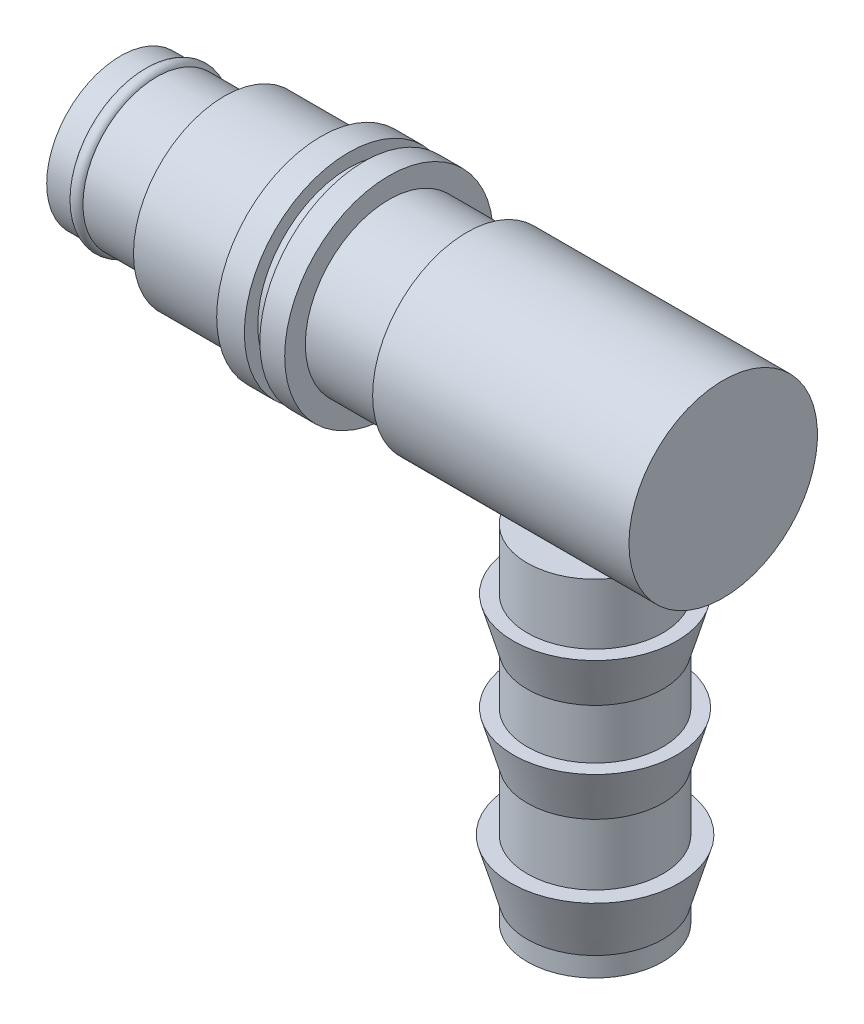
ISO-10303-21;
HEADER;
FILE_DESCRIPTION(('STEP AP214'),'2;1');
FILE_NAME('part.step','',(''),(''),'','','');
FILE_SCHEMA(('AUTOMOTIVE_DESIGN { 1 0 10303 214 1 1 1 1 }'));
ENDSEC;
DATA;
#1=APPLICATION_CONTEXT('core data for automotive mechanical design processes');
#2=APPLICATION_PROTOCOL_DEFINITION('international standard','automotive_design',2000,#1);
#3=PRODUCT_CONTEXT('',#1,'mechanical');
#4=PRODUCT('Part','Part','',(#3));
#5=PRODUCT_RELATED_PRODUCT_CATEGORY('part','',(#4));
#6=PRODUCT_DEFINITION_FORMATION('','',#4);
#7=PRODUCT_DEFINITION_CONTEXT('part definition',#1,'design');
#8=PRODUCT_DEFINITION('design','',#6,#7);
#9=PRODUCT_DEFINITION_SHAPE('','',#8);
#10=(LENGTH_UNIT() NAMED_UNIT(*) SI_UNIT(.MILLI.,.METRE.));
#11=(NAMED_UNIT(*) PLANE_ANGLE_UNIT() SI_UNIT($,.RADIAN.));
#12=(NAMED_UNIT(*) SI_UNIT($,.STERADIAN.) SOLID_ANGLE_UNIT());
#13=UNCERTAINTY_MEASURE_WITH_UNIT(LENGTH_MEASURE(1.E-05),#10,'distance_accuracy_value','');
#14=(GEOMETRIC_REPRESENTATION_CONTEXT(3) GLOBAL_UNCERTAINTY_ASSIGNED_CONTEXT((#13)) GLOBAL_UNIT_ASSIGNED_CONTEXT((#10,
#11,#12)) REPRESENTATION_CONTEXT('',''));
#15=CARTESIAN_POINT('',(0.,0.,0.));
#16=DIRECTION('',(0.,0.,1.));
#17=DIRECTION('',(1.,0.,0.));
#18=AXIS2_PLACEMENT_3D('',#15,#16,#17);
#19=CARTESIAN_POINT('',(0.,0.,0.));
#20=DIRECTION('',(-1.,0.,0.));
#21=DIRECTION('',(0.,0.,1.));
#22=AXIS2_PLACEMENT_3D('',#19,#20,#21);
#23=CYLINDRICAL_SURFACE('',#22,7.07715720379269);
#24=CARTESIAN_POINT('',(0.,0.,0.));
#25=DIRECTION('',(-1.,0.,0.));
#26=DIRECTION('',(0.,0.,1.));
#27=AXIS2_PLACEMENT_3D('',#24,#25,#26);
#28=CIRCLE('',#27,7.07715720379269);
#29=CARTESIAN_POINT('',(0.,0.,7.07715720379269));
#30=VERTEX_POINT('',#29);
#31=EDGE_CURVE('P0_E61',#30,#30,#28,.T.);
#32=ORIENTED_EDGE('',*,*,#31,.F.);
#33=EDGE_LOOP('',(#32));
#34=FACE_BOUND('',#33,.T.);
#35=CARTESIAN_POINT('',(2.30534147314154,0.,0.));
#36=DIRECTION('',(-1.,0.,0.));
#37=DIRECTION('',(0.,0.,1.));
#38=AXIS2_PLACEMENT_3D('',#35,#36,#37);
#39=CIRCLE('',#38,7.07715720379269);
#40=CARTESIAN_POINT('',(2.30534147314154,0.,7.07715720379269));
#41=VERTEX_POINT('',#40);
#42=EDGE_CURVE('P0_E9',#41,#41,#39,.T.);
#43=ORIENTED_EDGE('',*,*,#42,.T.);
#44=EDGE_LOOP('',(#43));
#45=FACE_BOUND('',#44,.T.);
#46=ADVANCED_FACE('P0_F14',(#34,#45),#23,.T.);
#47=CARTESIAN_POINT('',(2.88991003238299,0.,0.));
#48=DIRECTION('',(-1.,0.,0.));
#49=DIRECTION('',(0.,0.,1.));
#50=AXIS2_PLACEMENT_3D('',#47,#48,#49);
#51=TOROIDAL_SURFACE('',#50,6.84108143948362,0.630438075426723);
#52=ORIENTED_EDGE('',*,*,#42,.F.);
#53=EDGE_LOOP('',(#52));
#54=FACE_BOUND('',#53,.T.);
#55=CARTESIAN_POINT('',(3.47447859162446,0.,0.));
#56=DIRECTION('',(-1.,0.,0.));
#57=DIRECTION('',(0.,0.,1.));
#58=AXIS2_PLACEMENT_3D('',#55,#56,#57);
#59=CIRCLE('',#58,7.07715720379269);
#60=CARTESIAN_POINT('',(3.47447859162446,0.,7.07715720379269));
#61=VERTEX_POINT('',#60);
#62=EDGE_CURVE('P0_E20',#61,#61,#59,.T.);
#63=ORIENTED_EDGE('',*,*,#62,.T.);
#64=EDGE_LOOP('',(#63));
#65=FACE_BOUND('',#64,.T.);
#66=ADVANCED_FACE('P0_F111',(#54,#65),#51,.T.);
#67=CARTESIAN_POINT('',(0.,0.,0.));
#68=DIRECTION('',(-1.,0.,0.));
#69=DIRECTION('',(0.,0.,1.));
#70=AXIS2_PLACEMENT_3D('',#67,#68,#69);
#71=CYLINDRICAL_SURFACE('',#70,7.07715720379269);
#72=ORIENTED_EDGE('',*,*,#62,.F.);
#73=EDGE_LOOP('',(#72));
#74=FACE_BOUND('',#73,.T.);
#75=CARTESIAN_POINT('',(9.95613472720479,0.,0.));
#76=DIRECTION('',(-1.,0.,0.));
#77=DIRECTION('',(0.,0.,1.));
#78=AXIS2_PLACEMENT_3D('',#75,#76,#77);
#79=CIRCLE('',#78,7.07715720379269);
#80=CARTESIAN_POINT('',(9.95613472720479,0.,7.07715720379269));
#81=VERTEX_POINT('',#80);
#82=EDGE_CURVE('P0_E24',#81,#81,#79,.T.);
#83=ORIENTED_EDGE('',*,*,#82,.T.);
#84=EDGE_LOOP('',(#83));
#85=FACE_BOUND('',#84,.T.);
#86=ADVANCED_FACE('P0_F117',(#74,#85),#71,.T.);
#87=CARTESIAN_POINT('',(9.95613472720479,7.07715720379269,0.));
#88=DIRECTION('',(1.,0.,0.));
#89=DIRECTION('',(0.,0.,-1.));
#90=AXIS2_PLACEMENT_3D('',#87,#88,#89);
#91=PLANE('',#90);
#92=ORIENTED_EDGE('',*,*,#82,.F.);
#93=EDGE_LOOP('',(#92));
#94=FACE_BOUND('',#93,.T.);
#95=CARTESIAN_POINT('',(9.95613472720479,0.,0.));
#96=DIRECTION('',(-1.,0.,0.));
#97=DIRECTION('',(0.,0.,1.));
#98=AXIS2_PLACEMENT_3D('',#95,#96,#97);
#99=CIRCLE('',#98,8.71439657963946);
#100=CARTESIAN_POINT('',(9.95613472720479,0.,8.71439657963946));
#101=VERTEX_POINT('',#100);
#102=EDGE_CURVE('P0_E28',#101,#101,#99,.T.);
#103=ORIENTED_EDGE('',*,*,#102,.T.);
#104=EDGE_LOOP('',(#103));
#105=FACE_BOUND('',#104,.T.);
#106=ADVANCED_FACE('P0_F123',(#94,#105),#91,.F.);
#107=CARTESIAN_POINT('',(0.,0.,0.));
#108=DIRECTION('',(-1.,0.,0.));
#109=DIRECTION('',(0.,0.,1.));
#110=AXIS2_PLACEMENT_3D('',#107,#108,#109);
#111=CYLINDRICAL_SURFACE('',#110,8.71439657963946);
#112=ORIENTED_EDGE('',*,*,#102,.F.);
#113=EDGE_LOOP('',(#112));
#114=FACE_BOUND('',#113,.T.);
#115=CARTESIAN_POINT('',(19.2212798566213,0.,0.));
#116=DIRECTION('',(-1.,0.,0.));
#117=DIRECTION('',(0.,0.,1.));
#118=AXIS2_PLACEMENT_3D('',#115,#116,#117);
#119=CIRCLE('',#118,8.71439657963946);
#120=CARTESIAN_POINT('',(19.2212798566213,0.,8.71439657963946));
#121=VERTEX_POINT('',#120);
#122=EDGE_CURVE('P0_E33',#121,#121,#119,.T.);
#123=ORIENTED_EDGE('',*,*,#122,.T.);
#124=EDGE_LOOP('',(#123));
#125=FACE_BOUND('',#124,.T.);
#126=ADVANCED_FACE('P0_F129',(#114,#125),#111,.T.);
#127=CARTESIAN_POINT('',(19.2212798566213,8.71439657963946,0.));
#128=DIRECTION('',(1.,0.,0.));
#129=DIRECTION('',(0.,0.,-1.));
#130=AXIS2_PLACEMENT_3D('',#127,#128,#129);
#131=PLANE('',#130);
#132=ORIENTED_EDGE('',*,*,#122,.F.);
#133=EDGE_LOOP('',(#132));
#134=FACE_BOUND('',#133,.T.);
#135=CARTESIAN_POINT('',(19.2212798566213,0.,0.));
#136=DIRECTION('',(-1.,0.,0.));
#137=DIRECTION('',(0.,0.,1.));
#138=AXIS2_PLACEMENT_3D('',#135,#136,#137);
#139=CIRCLE('',#138,10.);
#140=CARTESIAN_POINT('',(19.2212798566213,0.,10.));
#141=VERTEX_POINT('',#140);
#142=EDGE_CURVE('P0_E36',#141,#141,#139,.T.);
#143=ORIENTED_EDGE('',*,*,#142,.T.);
#144=EDGE_LOOP('',(#143));
#145=FACE_BOUND('',#144,.T.);
#146=ADVANCED_FACE('P0_F133',(#134,#145),#131,.F.);
#147=CARTESIAN_POINT('',(0.,0.,0.));
#148=DIRECTION('',(-1.,0.,0.));
#149=DIRECTION('',(0.,0.,1.));
#150=AXIS2_PLACEMENT_3D('',#147,#148,#149);
#151=CYLINDRICAL_SURFACE('',#150,10.);
#152=ORIENTED_EDGE('',*,*,#142,.F.);
#153=EDGE_LOOP('',(#152));
#154=FACE_BOUND('',#153,.T.);
#155=CARTESIAN_POINT('',(21.8743217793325,0.,0.));
#156=DIRECTION('',(-1.,0.,0.));
#157=DIRECTION('',(0.,0.,1.));
#158=AXIS2_PLACEMENT_3D('',#155,#156,#157);
#159=CIRCLE('',#158,10.);
#160=CARTESIAN_POINT('',(21.8743217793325,0.,10.));
#161=VERTEX_POINT('',#160);
#162=EDGE_CURVE('P0_E39',#161,#161,#159,.T.);
#163=ORIENTED_EDGE('',*,*,#162,.T.);
#164=EDGE_LOOP('',(#163));
#165=FACE_BOUND('',#164,.T.);
#166=ADVANCED_FACE('P0_F137',(#154,#165),#151,.T.);
#167=CARTESIAN_POINT('',(21.8743217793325,10.,0.));
#168=DIRECTION('',(-1.,0.,0.));
#169=DIRECTION('',(0.,0.,1.));
#170=AXIS2_PLACEMENT_3D('',#167,#168,#169);
#171=PLANE('',#170);
#172=ORIENTED_EDGE('',*,*,#162,.F.);
#173=EDGE_LOOP('',(#172));
#174=FACE_BOUND('',#173,.T.);
#175=CARTESIAN_POINT('',(21.8743217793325,0.,0.));
#176=DIRECTION('',(-1.,0.,0.));
#177=DIRECTION('',(0.,0.,1.));
#178=AXIS2_PLACEMENT_3D('',#175,#176,#177);
#179=CIRCLE('',#178,8.71439657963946);
#180=CARTESIAN_POINT('',(21.8743217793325,0.,8.71439657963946));
#181=VERTEX_POINT('',#180);
#182=EDGE_CURVE('P0_E42',#181,#181,#179,.T.);
#183=ORIENTED_EDGE('',*,*,#182,.T.);
#184=EDGE_LOOP('',(#183));
#185=FACE_BOUND('',#184,.T.);
#186=ADVANCED_FACE('P0_F141',(#174,#185),#171,.F.);
#187=CARTESIAN_POINT('',(0.,0.,0.));
#188=DIRECTION('',(-1.,0.,0.));
#189=DIRECTION('',(0.,0.,1.));
#190=AXIS2_PLACEMENT_3D('',#187,#188,#189);
#191=CYLINDRICAL_SURFACE('',#190,8.71439657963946);
#192=ORIENTED_EDGE('',*,*,#182,.F.);
#193=EDGE_LOOP('',(#192));
#194=FACE_BOUND('',#193,.T.);
#195=CARTESIAN_POINT('',(23.3582265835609,0.,0.));
#196=DIRECTION('',(-1.,0.,0.));
#197=DIRECTION('',(0.,0.,1.));
#198=AXIS2_PLACEMENT_3D('',#195,#196,#197);
#199=CIRCLE('',#198,8.71439657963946);
#200=CARTESIAN_POINT('',(23.3582265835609,0.,8.71439657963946));
#201=VERTEX_POINT('',#200);
#202=EDGE_CURVE('P0_E45',#201,#201,#199,.T.);
#203=ORIENTED_EDGE('',*,*,#202,.T.);
#204=EDGE_LOOP('',(#203));
#205=FACE_BOUND('',#204,.T.);
#206=ADVANCED_FACE('P0_F145',(#194,#205),#191,.T.);
#207=CARTESIAN_POINT('',(23.3582265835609,8.71439657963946,0.));
#208=DIRECTION('',(1.,0.,0.));
#209=DIRECTION('',(0.,0.,-1.));
#210=AXIS2_PLACEMENT_3D('',#207,#208,#209);
#211=PLANE('',#210);
#212=ORIENTED_EDGE('',*,*,#202,.F.);
#213=EDGE_LOOP('',(#212));
#214=FACE_BOUND('',#213,.T.);
#215=CARTESIAN_POINT('',(23.3582265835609,0.,0.));
#216=DIRECTION('',(-1.,0.,0.));
#217=DIRECTION('',(0.,0.,1.));
#218=AXIS2_PLACEMENT_3D('',#215,#216,#217);
#219=CIRCLE('',#218,10.);
#220=CARTESIAN_POINT('',(23.3582265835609,0.,10.));
#221=VERTEX_POINT('',#220);
#222=EDGE_CURVE('P0_E48',#221,#221,#219,.T.);
#223=ORIENTED_EDGE('',*,*,#222,.T.);
#224=EDGE_LOOP('',(#223));
#225=FACE_BOUND('',#224,.T.);
#226=ADVANCED_FACE('P0_F149',(#214,#225),#211,.F.);
#227=CARTESIAN_POINT('',(0.,0.,0.));
#228=DIRECTION('',(-1.,0.,0.));
#229=DIRECTION('',(0.,0.,1.));
#230=AXIS2_PLACEMENT_3D('',#227,#228,#229);
#231=CYLINDRICAL_SURFACE('',#230,10.);
#232=ORIENTED_EDGE('',*,*,#222,.F.);
#233=EDGE_LOOP('',(#232));
#234=FACE_BOUND('',#233,.T.);
#235=CARTESIAN_POINT('',(25.7414676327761,0.,0.));
#236=DIRECTION('',(-1.,0.,0.));
#237=DIRECTION('',(0.,0.,1.));
#238=AXIS2_PLACEMENT_3D('',#235,#236,#237);
#239=CIRCLE('',#238,10.);
#240=CARTESIAN_POINT('',(25.7414676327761,0.,10.));
#241=VERTEX_POINT('',#240);
#242=EDGE_CURVE('P0_E51',#241,#241,#239,.T.);
#243=ORIENTED_EDGE('',*,*,#242,.T.);
#244=EDGE_LOOP('',(#243));
#245=FACE_BOUND('',#244,.T.);
#246=ADVANCED_FACE('P0_F153',(#234,#245),#231,.T.);
#247=CARTESIAN_POINT('',(25.7414676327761,10.,0.));
#248=DIRECTION('',(-1.,0.,0.));
#249=DIRECTION('',(0.,0.,1.));
#250=AXIS2_PLACEMENT_3D('',#247,#248,#249);
#251=PLANE('',#250);
#252=ORIENTED_EDGE('',*,*,#242,.F.);
#253=EDGE_LOOP('',(#252));
#254=FACE_BOUND('',#253,.T.);
#255=CARTESIAN_POINT('',(25.7414676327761,0.,0.));
#256=DIRECTION('',(-1.,0.,0.));
#257=DIRECTION('',(0.,0.,1.));
#258=AXIS2_PLACEMENT_3D('',#255,#256,#257);
#259=CIRCLE('',#258,8.0214602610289);
#260=CARTESIAN_POINT('',(25.7414676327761,0.,8.0214602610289));
#261=VERTEX_POINT('',#260);
#262=EDGE_CURVE('P0_E54',#261,#261,#259,.T.);
#263=ORIENTED_EDGE('',*,*,#262,.T.);
#264=EDGE_LOOP('',(#263));
#265=FACE_BOUND('',#264,.T.);
#266=ADVANCED_FACE('P0_F157',(#254,#265),#251,.F.);
#267=CARTESIAN_POINT('',(0.,0.,0.));
#268=DIRECTION('',(-1.,0.,0.));
#269=DIRECTION('',(0.,0.,1.));
#270=AXIS2_PLACEMENT_3D('',#267,#268,#269);
#271=CYLINDRICAL_SURFACE('',#270,8.0214602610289);
#272=ORIENTED_EDGE('',*,*,#262,.F.);
#273=EDGE_LOOP('',(#272));
#274=FACE_BOUND('',#273,.T.);
#275=CARTESIAN_POINT('',(33.2113990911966,0.,0.));
#276=DIRECTION('',(-1.,0.,0.));
#277=DIRECTION('',(0.,0.,1.));
#278=AXIS2_PLACEMENT_3D('',#275,#276,#277);
#279=CIRCLE('',#278,8.0214602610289);
#280=CARTESIAN_POINT('',(33.2113990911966,0.,8.0214602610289));
#281=VERTEX_POINT('',#280);
#282=EDGE_CURVE('P0_E58',#281,#281,#279,.T.);
#283=ORIENTED_EDGE('',*,*,#282,.T.);
#284=EDGE_LOOP('',(#283));
#285=FACE_BOUND('',#284,.T.);
#286=ADVANCED_FACE('P0_F101',(#274,#285),#271,.T.);
#287=CARTESIAN_POINT('',(0.,0.,0.));
#288=DIRECTION('',(-1.,0.,0.));
#289=DIRECTION('',(0.,0.,1.));
#290=AXIS2_PLACEMENT_3D('',#287,#288,#289);
#291=CYLINDRICAL_SURFACE('',#290,2.67040960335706);
#292=CARTESIAN_POINT('',(33.2113990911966,0.,0.));
#293=DIRECTION('',(-1.,0.,0.));
#294=DIRECTION('',(0.,0.,1.));
#295=AXIS2_PLACEMENT_3D('',#292,#293,#294);
#296=CIRCLE('',#295,2.67040960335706);
#297=CARTESIAN_POINT('',(33.2113990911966,0.,2.67040960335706));
#298=VERTEX_POINT('',#297);
#299=EDGE_CURVE('P0_E57',#298,#298,#296,.T.);
#300=ORIENTED_EDGE('',*,*,#299,.F.);
#301=EDGE_LOOP('',(#300));
#302=FACE_BOUND('',#301,.T.);
#303=CARTESIAN_POINT('',(0.,0.,0.));
#304=DIRECTION('',(-1.,0.,0.));
#305=DIRECTION('',(0.,0.,1.));
#306=AXIS2_PLACEMENT_3D('',#303,#304,#305);
#307=CIRCLE('',#306,2.67040960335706);
#308=CARTESIAN_POINT('',(0.,0.,2.67040960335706));
#309=VERTEX_POINT('',#308);
#310=EDGE_CURVE('P0_E65',#309,#309,#307,.T.);
#311=ORIENTED_EDGE('',*,*,#310,.T.);
#312=EDGE_LOOP('',(#311));
#313=FACE_BOUND('',#312,.T.);
#314=ADVANCED_FACE('P0_F97',(#302,#313),#291,.F.);
#315=CARTESIAN_POINT('',(0.,2.67040960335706,0.));
#316=DIRECTION('',(1.,0.,0.));
#317=DIRECTION('',(0.,0.,-1.));
#318=AXIS2_PLACEMENT_3D('',#315,#316,#317);
#319=PLANE('',#318);
#320=ORIENTED_EDGE('',*,*,#310,.F.);
#321=EDGE_LOOP('',(#320));
#322=FACE_BOUND('',#321,.T.);
#323=ORIENTED_EDGE('',*,*,#31,.T.);
#324=EDGE_LOOP('',(#323));
#325=FACE_BOUND('',#324,.T.);
#326=ADVANCED_FACE('P0_F100',(#322,#325),#319,.F.);
#327=CARTESIAN_POINT('',(51.4339968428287,0.,0.));
#328=DIRECTION('',(1.,0.,0.));
#329=DIRECTION('',(0.,0.,-1.));
#330=AXIS2_PLACEMENT_3D('',#327,#328,#329);
#331=PLANE('',#330);
#332=CARTESIAN_POINT('',(51.4339968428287,0.,0.));
#333=DIRECTION('',(-1.,0.,0.));
#334=DIRECTION('',(0.,0.,1.));
#335=AXIS2_PLACEMENT_3D('',#332,#333,#334);
#336=CIRCLE('',#335,2.5);
#337=CARTESIAN_POINT('',(51.4339968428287,0.,2.5));
#338=VERTEX_POINT('',#337);
#339=EDGE_CURVE('P0_E78',#338,#338,#336,.T.);
#340=ORIENTED_EDGE('',*,*,#339,.T.);
#341=EDGE_LOOP('',(#340));
#342=FACE_BOUND('',#341,.T.);
#343=ADVANCED_FACE('P0_F82',(#342),#331,.F.);
#344=CARTESIAN_POINT('',(33.2113990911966,0.,0.));
#345=DIRECTION('',(-1.,0.,0.));
#346=DIRECTION('',(0.,0.,1.));
#347=AXIS2_PLACEMENT_3D('',#344,#345,#346);
#348=CYLINDRICAL_SURFACE('',#347,2.5);
#349=ORIENTED_EDGE('',*,*,#339,.F.);
#350=EDGE_LOOP('',(#349));
#351=FACE_BOUND('',#350,.T.);
#352=CARTESIAN_POINT('',(33.2113990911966,0.,0.));
#353=DIRECTION('',(-1.,0.,0.));
#354=DIRECTION('',(0.,0.,1.));
#355=AXIS2_PLACEMENT_3D('',#352,#353,#354);
#356=CIRCLE('',#355,2.5);
#357=CARTESIAN_POINT('',(33.2113990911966,0.,2.5));
#358=VERTEX_POINT('',#357);
#359=EDGE_CURVE('P0_E62',#358,#358,#356,.T.);
#360=ORIENTED_EDGE('',*,*,#359,.T.);
#361=EDGE_LOOP('',(#360));
#362=FACE_BOUND('',#361,.T.);
#363=ADVANCED_FACE('P0_F84',(#351,#362),#348,.F.);
#364=CARTESIAN_POINT('',(33.2113990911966,2.5,0.));
#365=DIRECTION('',(1.,0.,0.));
#366=DIRECTION('',(0.,0.,-1.));
#367=AXIS2_PLACEMENT_3D('',#364,#365,#366);
#368=PLANE('',#367);
#369=ORIENTED_EDGE('',*,*,#359,.F.);
#370=EDGE_LOOP('',(#369));
#371=FACE_BOUND('',#370,.T.);
#372=ORIENTED_EDGE('',*,*,#299,.T.);
#373=EDGE_LOOP('',(#372));
#374=FACE_BOUND('',#373,.T.);
#375=ADVANCED_FACE('P0_F87',(#371,#374),#368,.F.);
#376=ORIENTED_EDGE('',*,*,#282,.F.);
#377=EDGE_LOOP('',(#376));
#378=FACE_BOUND('',#377,.T.);
#379=CARTESIAN_POINT('',(33.2113990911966,0.,0.));
#380=DIRECTION('',(-1.,0.,0.));
#381=DIRECTION('',(0.,0.,1.));
#382=AXIS2_PLACEMENT_3D('',#379,#380,#381);
#383=CIRCLE('',#382,9.03773569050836);
#384=CARTESIAN_POINT('',(33.2113990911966,0.,9.03773569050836));
#385=VERTEX_POINT('',#384);
#386=EDGE_CURVE('P0_E72',#385,#385,#383,.T.);
#387=ORIENTED_EDGE('',*,*,#386,.T.);
#388=EDGE_LOOP('',(#387));
#389=FACE_BOUND('',#388,.T.);
#390=ADVANCED_FACE('P0_F93',(#378,#389),#368,.F.);
#391=CARTESIAN_POINT('',(33.2113990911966,0.,0.));
#392=DIRECTION('',(-1.,0.,0.));
#393=DIRECTION('',(0.,0.,1.));
#394=AXIS2_PLACEMENT_3D('',#391,#392,#393);
#395=CYLINDRICAL_SURFACE('',#394,9.03773569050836);
#396=ORIENTED_EDGE('',*,*,#386,.F.);
#397=EDGE_LOOP('',(#396));
#398=FACE_BOUND('',#397,.T.);
#399=CARTESIAN_POINT('',(57.7886009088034,0.,0.));
#400=DIRECTION('',(-1.,0.,0.));
#401=DIRECTION('',(0.,0.,1.));
#402=AXIS2_PLACEMENT_3D('',#399,#400,#401);
#403=CIRCLE('',#402,9.03773569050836);
#404=CARTESIAN_POINT('',(57.7886009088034,0.,9.03773569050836));
#405=VERTEX_POINT('',#404);
#406=EDGE_CURVE('P0_E75',#405,#405,#403,.T.);
#407=ORIENTED_EDGE('',*,*,#406,.T.);
#408=EDGE_LOOP('',(#407));
#409=FACE_BOUND('',#408,.T.);
#410=ADVANCED_FACE('P0_F166',(#398,#409),#395,.T.);
#411=CARTESIAN_POINT('',(57.7886009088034,2.5,0.));
#412=DIRECTION('',(-1.,0.,0.));
#413=DIRECTION('',(0.,0.,1.));
#414=AXIS2_PLACEMENT_3D('',#411,#412,#413);
#415=PLANE('',#414);
#416=ORIENTED_EDGE('',*,*,#406,.F.);
#417=EDGE_LOOP('',(#416));
#418=FACE_BOUND('',#417,.T.);
#419=ADVANCED_FACE('P0_F170',(#418),#415,.F.);
#420=CLOSED_SHELL('',(#46,#66,#86,#106,#126,#146,#166,#186,#206,#226,#246,#266,#286,#314,#326,
#343,#363,#375,#390,#410,#419));
#421=MANIFOLD_SOLID_BREP('P0_B1',#420);
#422=CARTESIAN_POINT('',(45.5,-9.03773569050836,0.));
#423=DIRECTION('',(0.,-1.,0.));
#424=DIRECTION('',(0.,0.,-1.));
#425=AXIS2_PLACEMENT_3D('',#422,#423,#424);
#426=PLANE('',#425);
#427=CARTESIAN_POINT('',(45.5,-9.03773569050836,0.));
#428=DIRECTION('',(0.,1.,0.));
#429=DIRECTION('',(0.,0.,1.));
#430=AXIS2_PLACEMENT_3D('',#427,#428,#429);
#431=CIRCLE('',#430,6.5);
#432=CARTESIAN_POINT('',(45.5,-9.03773569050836,6.5));
#433=VERTEX_POINT('',#432);
#434=EDGE_CURVE('P1_E9',#433,#433,#431,.T.);
#435=ORIENTED_EDGE('',*,*,#434,.T.);
#436=EDGE_LOOP('',(#435));
#437=FACE_BOUND('',#436,.T.);
#438=ADVANCED_FACE('P1_F14',(#437),#426,.F.);
#439=CARTESIAN_POINT('',(45.5,-9.03773569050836,0.));
#440=DIRECTION('',(0.,1.,0.));
#441=DIRECTION('',(0.,0.,1.));
#442=AXIS2_PLACEMENT_3D('',#439,#440,#441);
#443=CYLINDRICAL_SURFACE('',#442,6.5);
#444=ORIENTED_EDGE('',*,*,#434,.F.);
#445=EDGE_LOOP('',(#444));
#446=FACE_BOUND('',#445,.T.);
#447=CARTESIAN_POINT('',(45.5,-14.8419196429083,0.));
#448=DIRECTION('',(0.,1.,0.));
#449=DIRECTION('',(0.,0.,1.));
#450=AXIS2_PLACEMENT_3D('',#447,#448,#449);
#451=CIRCLE('',#450,6.5);
#452=CARTESIAN_POINT('',(45.5,-14.8419196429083,6.5));
#453=VERTEX_POINT('',#452);
#454=EDGE_CURVE('P1_E20',#453,#453,#451,.T.);
#455=ORIENTED_EDGE('',*,*,#454,.T.);
#456=EDGE_LOOP('',(#455));
#457=FACE_BOUND('',#456,.T.);
#458=ADVANCED_FACE('P1_F69',(#446,#457),#443,.T.);
#459=CARTESIAN_POINT('',(52.,-14.8419196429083,0.));
#460=DIRECTION('',(0.,-1.,0.));
#461=DIRECTION('',(0.,0.,-1.));
#462=AXIS2_PLACEMENT_3D('',#459,#460,#461);
#463=PLANE('',#462);
#464=ORIENTED_EDGE('',*,*,#454,.F.);
#465=EDGE_LOOP('',(#464));
#466=FACE_BOUND('',#465,.T.);
#467=CARTESIAN_POINT('',(45.5,-14.8419196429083,0.));
#468=DIRECTION('',(0.,1.,0.));
#469=DIRECTION('',(0.,0.,1.));
#470=AXIS2_PLACEMENT_3D('',#467,#468,#469);
#471=CIRCLE('',#470,7.8401623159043);
#472=CARTESIAN_POINT('',(45.5,-14.8419196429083,7.8401623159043));
#473=VERTEX_POINT('',#472);
#474=EDGE_CURVE('P1_E24',#473,#473,#471,.T.);
#475=ORIENTED_EDGE('',*,*,#474,.T.);
#476=EDGE_LOOP('',(#475));
#477=FACE_BOUND('',#476,.T.);
#478=ADVANCED_FACE('P1_F74',(#466,#477),#463,.F.);
#479=CARTESIAN_POINT('',(45.5,-19.5131972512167,0.));
#480=DIRECTION('',(0.,1.,0.));
#481=DIRECTION('',(0.,0.,1.));
#482=AXIS2_PLACEMENT_3D('',#479,#480,#481);
#483=CONICAL_SURFACE('',#482,6.5,0.279390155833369);
#484=ORIENTED_EDGE('',*,*,#474,.F.);
#485=EDGE_LOOP('',(#484));
#486=FACE_BOUND('',#485,.T.);
#487=CARTESIAN_POINT('',(45.5,-19.5131972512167,0.));
#488=DIRECTION('',(0.,1.,0.));
#489=DIRECTION('',(0.,0.,1.));
#490=AXIS2_PLACEMENT_3D('',#487,#488,#489);
#491=CIRCLE('',#490,6.5);
#492=CARTESIAN_POINT('',(45.5,-19.5131972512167,6.5));
#493=VERTEX_POINT('',#492);
#494=EDGE_CURVE('P1_E28',#493,#493,#491,.T.);
#495=ORIENTED_EDGE('',*,*,#494,.T.);
#496=EDGE_LOOP('',(#495));
#497=FACE_BOUND('',#496,.T.);
#498=ADVANCED_FACE('P1_F80',(#486,#497),#483,.T.);
#499=CARTESIAN_POINT('',(45.5,-9.03773569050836,0.));
#500=DIRECTION('',(0.,1.,0.));
#501=DIRECTION('',(0.,0.,1.));
#502=AXIS2_PLACEMENT_3D('',#499,#500,#501);
#503=CYLINDRICAL_SURFACE('',#502,6.5);
#504=ORIENTED_EDGE('',*,*,#494,.F.);
#505=EDGE_LOOP('',(#504));
#506=FACE_BOUND('',#505,.T.);
#507=CARTESIAN_POINT('',(45.5,-24.3042512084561,0.));
#508=DIRECTION('',(0.,1.,0.));
#509=DIRECTION('',(0.,0.,1.));
#510=AXIS2_PLACEMENT_3D('',#507,#508,#509);
#511=CIRCLE('',#510,6.5);
#512=CARTESIAN_POINT('',(45.5,-24.3042512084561,6.5));
#513=VERTEX_POINT('',#512);
#514=EDGE_CURVE('P1_E33',#513,#513,#511,.T.);
#515=ORIENTED_EDGE('',*,*,#514,.T.);
#516=EDGE_LOOP('',(#515));
#517=FACE_BOUND('',#516,.T.);
#518=ADVANCED_FACE('P1_F86',(#506,#517),#503,.T.);
#519=CARTESIAN_POINT('',(52.,-24.3042512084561,0.));
#520=DIRECTION('',(0.,-1.,0.));
#521=DIRECTION('',(0.,0.,-1.));
#522=AXIS2_PLACEMENT_3D('',#519,#520,#521);
#523=PLANE('',#522);
#524=ORIENTED_EDGE('',*,*,#514,.F.);
#525=EDGE_LOOP('',(#524));
#526=FACE_BOUND('',#525,.T.);
#527=CARTESIAN_POINT('',(45.5,-24.3042512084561,0.));
#528=DIRECTION('',(0.,1.,0.));
#529=DIRECTION('',(0.,0.,1.));
#530=AXIS2_PLACEMENT_3D('',#527,#528,#529);
#531=CIRCLE('',#530,7.8401623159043);
#532=CARTESIAN_POINT('',(45.5,-24.3042512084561,7.8401623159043));
#533=VERTEX_POINT('',#532);
#534=EDGE_CURVE('P1_E36',#533,#533,#531,.T.);
#535=ORIENTED_EDGE('',*,*,#534,.T.);
#536=EDGE_LOOP('',(#535));
#537=FACE_BOUND('',#536,.T.);
#538=ADVANCED_FACE('P1_F90',(#526,#537),#523,.F.);
#539=CARTESIAN_POINT('',(45.5,-28.9755288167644,0.));
#540=DIRECTION('',(0.,1.,0.));
#541=DIRECTION('',(0.,0.,1.));
#542=AXIS2_PLACEMENT_3D('',#539,#540,#541);
#543=CONICAL_SURFACE('',#542,6.5,0.279390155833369);
#544=ORIENTED_EDGE('',*,*,#534,.F.);
#545=EDGE_LOOP('',(#544));
#546=FACE_BOUND('',#545,.T.);
#547=CARTESIAN_POINT('',(45.5,-28.9755288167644,0.));
#548=DIRECTION('',(0.,1.,0.));
#549=DIRECTION('',(0.,0.,1.));
#550=AXIS2_PLACEMENT_3D('',#547,#548,#549);
#551=CIRCLE('',#550,6.5);
#552=CARTESIAN_POINT('',(45.5,-28.9755288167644,6.5));
#553=VERTEX_POINT('',#552);
#554=EDGE_CURVE('P1_E39',#553,#553,#551,.T.);
#555=ORIENTED_EDGE('',*,*,#554,.T.);
#556=EDGE_LOOP('',(#555));
#557=FACE_BOUND('',#556,.T.);
#558=ADVANCED_FACE('P1_F94',(#546,#557),#543,.T.);
#559=CARTESIAN_POINT('',(45.5,-9.03773569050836,0.));
#560=DIRECTION('',(0.,1.,0.));
#561=DIRECTION('',(0.,0.,1.));
#562=AXIS2_PLACEMENT_3D('',#559,#560,#561);
#563=CYLINDRICAL_SURFACE('',#562,6.5);
#564=ORIENTED_EDGE('',*,*,#554,.F.);
#565=EDGE_LOOP('',(#564));
#566=FACE_BOUND('',#565,.T.);
#567=CARTESIAN_POINT('',(45.5,-34.8445699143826,0.));
#568=DIRECTION('',(0.,1.,0.));
#569=DIRECTION('',(0.,0.,1.));
#570=AXIS2_PLACEMENT_3D('',#567,#568,#569);
#571=CIRCLE('',#570,6.5);
#572=CARTESIAN_POINT('',(45.5,-34.8445699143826,6.5));
#573=VERTEX_POINT('',#572);
#574=EDGE_CURVE('P1_E42',#573,#573,#571,.T.);
#575=ORIENTED_EDGE('',*,*,#574,.T.);
#576=EDGE_LOOP('',(#575));
#577=FACE_BOUND('',#576,.T.);
#578=ADVANCED_FACE('P1_F98',(#566,#577),#563,.T.);
#579=CARTESIAN_POINT('',(52.,-34.8445699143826,0.));
#580=DIRECTION('',(0.,-1.,0.));
#581=DIRECTION('',(0.,0.,-1.));
#582=AXIS2_PLACEMENT_3D('',#579,#580,#581);
#583=PLANE('',#582);
#584=ORIENTED_EDGE('',*,*,#574,.F.);
#585=EDGE_LOOP('',(#584));
#586=FACE_BOUND('',#585,.T.);
#587=CARTESIAN_POINT('',(45.5,-34.8445699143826,0.));
#588=DIRECTION('',(0.,1.,0.));
#589=DIRECTION('',(0.,0.,1.));
#590=AXIS2_PLACEMENT_3D('',#587,#588,#589);
#591=CIRCLE('',#590,8.06069092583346);
#592=CARTESIAN_POINT('',(45.5,-34.8445699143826,8.06069092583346));
#593=VERTEX_POINT('',#592);
#594=EDGE_CURVE('P1_E45',#593,#593,#591,.T.);
#595=ORIENTED_EDGE('',*,*,#594,.T.);
#596=EDGE_LOOP('',(#595));
#597=FACE_BOUND('',#596,.T.);
#598=ADVANCED_FACE('P1_F102',(#586,#597),#583,.F.);
#599=CARTESIAN_POINT('',(45.5,-40.2845233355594,0.));
#600=DIRECTION('',(0.,1.,0.));
#601=DIRECTION('',(0.,0.,1.));
#602=AXIS2_PLACEMENT_3D('',#599,#600,#601);
#603=CONICAL_SURFACE('',#602,6.5,0.279390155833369);
#604=ORIENTED_EDGE('',*,*,#594,.F.);
#605=EDGE_LOOP('',(#604));
#606=FACE_BOUND('',#605,.T.);
#607=CARTESIAN_POINT('',(45.5,-40.2845233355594,0.));
#608=DIRECTION('',(0.,1.,0.));
#609=DIRECTION('',(0.,0.,1.));
#610=AXIS2_PLACEMENT_3D('',#607,#608,#609);
#611=CIRCLE('',#610,6.5);
#612=CARTESIAN_POINT('',(45.5,-40.2845233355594,6.5));
#613=VERTEX_POINT('',#612);
#614=EDGE_CURVE('P1_E48',#613,#613,#611,.T.);
#615=ORIENTED_EDGE('',*,*,#614,.T.);
#616=EDGE_LOOP('',(#615));
#617=FACE_BOUND('',#616,.T.);
#618=ADVANCED_FACE('P1_F65',(#606,#617),#603,.T.);
#619=CARTESIAN_POINT('',(45.5,-9.03773569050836,0.));
#620=DIRECTION('',(0.,1.,0.));
#621=DIRECTION('',(0.,0.,1.));
#622=AXIS2_PLACEMENT_3D('',#619,#620,#621);
#623=CYLINDRICAL_SURFACE('',#622,6.5);
#624=ORIENTED_EDGE('',*,*,#614,.F.);
#625=EDGE_LOOP('',(#624));
#626=FACE_BOUND('',#625,.T.);
#627=CARTESIAN_POINT('',(45.5,-42.1509271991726,0.));
#628=DIRECTION('',(0.,1.,0.));
#629=DIRECTION('',(0.,0.,1.));
#630=AXIS2_PLACEMENT_3D('',#627,#628,#629);
#631=CIRCLE('',#630,6.5);
#632=CARTESIAN_POINT('',(45.5,-42.1509271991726,6.5));
#633=VERTEX_POINT('',#632);
#634=EDGE_CURVE('P1_E51',#633,#633,#631,.T.);
#635=ORIENTED_EDGE('',*,*,#634,.T.);
#636=EDGE_LOOP('',(#635));
#637=FACE_BOUND('',#636,.T.);
#638=ADVANCED_FACE('P1_F55',(#626,#637),#623,.T.);
#639=CARTESIAN_POINT('',(52.,-42.1509271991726,0.));
#640=DIRECTION('',(0.,1.,0.));
#641=DIRECTION('',(0.,0.,1.));
#642=AXIS2_PLACEMENT_3D('',#639,#640,#641);
#643=PLANE('',#642);
#644=ORIENTED_EDGE('',*,*,#634,.F.);
#645=EDGE_LOOP('',(#644));
#646=FACE_BOUND('',#645,.T.);
#647=ADVANCED_FACE('P1_F57',(#646),#643,.F.);
#648=CLOSED_SHELL('',(#438,#458,#478,#498,#518,#538,#558,#578,#598,#618,#638,#647));
#649=MANIFOLD_SOLID_BREP('P1_B1',#648);
#650=ADVANCED_BREP_SHAPE_REPRESENTATION('',(#18,#421,#649),#14);
#651=SHAPE_DEFINITION_REPRESENTATION(#9,#650);
ENDSEC;
END-ISO-10303-21;
